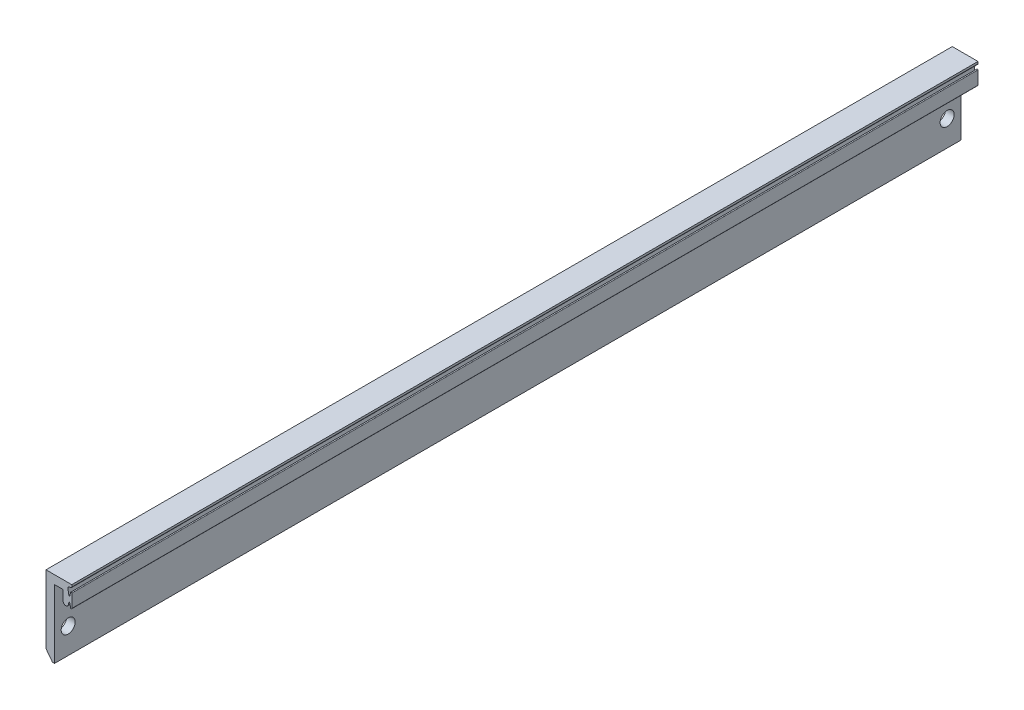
ISO-10303-21;
HEADER;
FILE_DESCRIPTION(('STEP AP214'),'2;1');
FILE_NAME('part.step','',(''),(''),'','','');
FILE_SCHEMA(('AUTOMOTIVE_DESIGN { 1 0 10303 214 1 1 1 1 }'));
ENDSEC;
DATA;
#1=APPLICATION_CONTEXT('core data for automotive mechanical design processes');
#2=APPLICATION_PROTOCOL_DEFINITION('international standard','automotive_design',2000,#1);
#3=PRODUCT_CONTEXT('',#1,'mechanical');
#4=PRODUCT('Part','Part','',(#3));
#5=PRODUCT_RELATED_PRODUCT_CATEGORY('part','',(#4));
#6=PRODUCT_DEFINITION_FORMATION('','',#4);
#7=PRODUCT_DEFINITION_CONTEXT('part definition',#1,'design');
#8=PRODUCT_DEFINITION('design','',#6,#7);
#9=PRODUCT_DEFINITION_SHAPE('','',#8);
#10=(LENGTH_UNIT() NAMED_UNIT(*) SI_UNIT(.MILLI.,.METRE.));
#11=(NAMED_UNIT(*) PLANE_ANGLE_UNIT() SI_UNIT($,.RADIAN.));
#12=(NAMED_UNIT(*) SI_UNIT($,.STERADIAN.) SOLID_ANGLE_UNIT());
#13=UNCERTAINTY_MEASURE_WITH_UNIT(LENGTH_MEASURE(1.E-05),#10,'distance_accuracy_value','');
#14=(GEOMETRIC_REPRESENTATION_CONTEXT(3) GLOBAL_UNCERTAINTY_ASSIGNED_CONTEXT((#13)) GLOBAL_UNIT_ASSIGNED_CONTEXT((#10,
#11,#12)) REPRESENTATION_CONTEXT('',''));
#15=CARTESIAN_POINT('',(0.,0.,0.));
#16=DIRECTION('',(0.,0.,1.));
#17=DIRECTION('',(1.,0.,0.));
#18=AXIS2_PLACEMENT_3D('',#15,#16,#17);
#19=CARTESIAN_POINT('',(2473.35258692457,1.1297441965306E-09,132.675));
#20=DIRECTION('',(1.,4.56766335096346E-13,0.));
#21=DIRECTION('',(-4.56766335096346E-13,1.,0.));
#22=AXIS2_PLACEMENT_3D('',#19,#20,#21);
#23=PLANE('',#22);
#24=DIRECTION('',(4.56766335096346E-13,-1.,0.));
#25=VECTOR('',#24,1.);
#26=CARTESIAN_POINT('',(2473.35258692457,1.1297441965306E-09,-132.675));
#27=LINE('',#26,#25);
#28=CARTESIAN_POINT('',(2473.35258692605,-3238.37710777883,-132.675));
#29=VERTEX_POINT('',#28);
#30=CARTESIAN_POINT('',(2473.35258692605,-3241.29384556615,-132.675));
#31=VERTEX_POINT('',#30);
#32=EDGE_CURVE('E211',#29,#31,#27,.T.);
#33=ORIENTED_EDGE('',*,*,#32,.T.);
#34=DIRECTION('',(0.,0.,-1.));
#35=VECTOR('',#34,1.);
#36=CARTESIAN_POINT('',(2473.35258692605,-3241.29384556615,132.675));
#37=LINE('',#36,#35);
#38=CARTESIAN_POINT('',(2473.35258692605,-3241.29384556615,132.675));
#39=VERTEX_POINT('',#38);
#40=EDGE_CURVE('E11',#39,#31,#37,.T.);
#41=ORIENTED_EDGE('',*,*,#40,.F.);
#42=DIRECTION('',(4.56766335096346E-13,-1.,0.));
#43=VECTOR('',#42,1.);
#44=CARTESIAN_POINT('',(2473.35258692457,1.1297441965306E-09,132.675));
#45=LINE('',#44,#43);
#46=CARTESIAN_POINT('',(2473.35258692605,-3238.37710777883,132.675));
#47=VERTEX_POINT('',#46);
#48=EDGE_CURVE('E265',#47,#39,#45,.T.);
#49=ORIENTED_EDGE('',*,*,#48,.F.);
#50=DIRECTION('',(0.,0.,-1.));
#51=VECTOR('',#50,1.);
#52=CARTESIAN_POINT('',(2473.35258692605,-3238.37710777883,132.675));
#53=LINE('',#52,#51);
#54=EDGE_CURVE('E207',#47,#29,#53,.T.);
#55=ORIENTED_EDGE('',*,*,#54,.T.);
#56=EDGE_LOOP('',(#33,#41,#49,#55));
#57=FACE_BOUND('',#56,.T.);
#58=ADVANCED_FACE('F37',(#57),#23,.F.);
#59=CARTESIAN_POINT('',(2474.13562881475,-3241.29384556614,132.675));
#60=DIRECTION('',(0.,0.,-1.));
#61=DIRECTION('',(-1.,0.,0.));
#62=AXIS2_PLACEMENT_3D('',#59,#60,#61);
#63=CYLINDRICAL_SURFACE('',#62,0.783041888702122);
#64=CARTESIAN_POINT('',(2474.13562881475,-3241.29384556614,-132.675));
#65=DIRECTION('',(0.,0.,1.));
#66=DIRECTION('',(1.,0.,0.));
#67=AXIS2_PLACEMENT_3D('',#64,#65,#66);
#68=CIRCLE('',#67,0.783041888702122);
#69=CARTESIAN_POINT('',(2474.90170185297,-3241.4559773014,-132.675));
#70=VERTEX_POINT('',#69);
#71=EDGE_CURVE('E214',#31,#70,#68,.T.);
#72=ORIENTED_EDGE('',*,*,#71,.T.);
#73=DIRECTION('',(0.,0.,-1.));
#74=VECTOR('',#73,1.);
#75=CARTESIAN_POINT('',(2474.90170185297,-3241.4559773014,132.675));
#76=LINE('',#75,#74);
#77=CARTESIAN_POINT('',(2474.90170185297,-3241.4559773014,132.675));
#78=VERTEX_POINT('',#77);
#79=EDGE_CURVE('E46',#78,#70,#76,.T.);
#80=ORIENTED_EDGE('',*,*,#79,.F.);
#81=CARTESIAN_POINT('',(2474.13562881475,-3241.29384556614,132.675));
#82=DIRECTION('',(0.,0.,1.));
#83=DIRECTION('',(1.,0.,0.));
#84=AXIS2_PLACEMENT_3D('',#81,#82,#83);
#85=CIRCLE('',#84,0.783041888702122);
#86=EDGE_CURVE('E133',#39,#78,#85,.T.);
#87=ORIENTED_EDGE('',*,*,#86,.F.);
#88=ORIENTED_EDGE('',*,*,#40,.T.);
#89=EDGE_LOOP('',(#72,#80,#87,#88));
#90=FACE_BOUND('',#89,.T.);
#91=ADVANCED_FACE('F383',(#90),#63,.T.);
#92=CARTESIAN_POINT('',(3025.41088073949,-640.298106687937,132.675));
#93=DIRECTION('',(-0.978329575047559,0.207053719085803,0.));
#94=DIRECTION('',(-0.207053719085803,-0.978329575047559,0.));
#95=AXIS2_PLACEMENT_3D('',#92,#93,#94);
#96=PLANE('',#95);
#97=DIRECTION('',(0.207053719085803,0.978329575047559,0.));
#98=VECTOR('',#97,1.);
#99=CARTESIAN_POINT('',(3025.41088073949,-640.298106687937,-132.675));
#100=LINE('',#99,#98);
#101=CARTESIAN_POINT('',(2475.03432887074,-3240.82931416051,-132.675));
#102=VERTEX_POINT('',#101);
#103=EDGE_CURVE('E217',#70,#102,#100,.T.);
#104=ORIENTED_EDGE('',*,*,#103,.T.);
#105=DIRECTION('',(0.,0.,-1.));
#106=VECTOR('',#105,1.);
#107=CARTESIAN_POINT('',(2475.03432887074,-3240.82931416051,132.675));
#108=LINE('',#107,#106);
#109=CARTESIAN_POINT('',(2475.03432887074,-3240.82931416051,132.675));
#110=VERTEX_POINT('',#109);
#111=EDGE_CURVE('E301',#110,#102,#108,.T.);
#112=ORIENTED_EDGE('',*,*,#111,.F.);
#113=DIRECTION('',(0.207053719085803,0.978329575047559,0.));
#114=VECTOR('',#113,1.);
#115=CARTESIAN_POINT('',(3025.41088073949,-640.298106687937,132.675));
#116=LINE('',#115,#114);
#117=EDGE_CURVE('E318',#78,#110,#116,.T.);
#118=ORIENTED_EDGE('',*,*,#117,.F.);
#119=ORIENTED_EDGE('',*,*,#79,.T.);
#120=EDGE_LOOP('',(#104,#112,#118,#119));
#121=FACE_BOUND('',#120,.T.);
#122=ADVANCED_FACE('F387',(#121),#96,.F.);
#123=CARTESIAN_POINT('',(2475.18258692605,-3240.85210777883,132.675));
#124=DIRECTION('',(0.,0.,-1.));
#125=DIRECTION('',(-1.,0.,0.));
#126=AXIS2_PLACEMENT_3D('',#123,#124,#125);
#127=CYLINDRICAL_SURFACE('',#126,0.149999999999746);
#128=CARTESIAN_POINT('',(2475.18258692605,-3240.85210777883,-132.675));
#129=DIRECTION('',(0.,0.,1.));
#130=DIRECTION('',(1.,0.,0.));
#131=AXIS2_PLACEMENT_3D('',#128,#129,#130);
#132=CIRCLE('',#131,0.149999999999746);
#133=CARTESIAN_POINT('',(2475.32961411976,-3240.82239239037,-132.675));
#134=VERTEX_POINT('',#133);
#135=EDGE_CURVE('E220',#134,#102,#132,.T.);
#136=ORIENTED_EDGE('',*,*,#135,.F.);
#137=DIRECTION('',(0.,0.,-1.));
#138=VECTOR('',#137,1.);
#139=CARTESIAN_POINT('',(2475.32961411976,-3240.82239239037,132.675));
#140=LINE('',#139,#138);
#141=CARTESIAN_POINT('',(2475.32961411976,-3240.82239239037,132.675));
#142=VERTEX_POINT('',#141);
#143=EDGE_CURVE('E299',#142,#134,#140,.T.);
#144=ORIENTED_EDGE('',*,*,#143,.F.);
#145=CARTESIAN_POINT('',(2475.18258692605,-3240.85210777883,132.675));
#146=DIRECTION('',(0.,0.,1.));
#147=DIRECTION('',(1.,0.,0.));
#148=AXIS2_PLACEMENT_3D('',#145,#146,#147);
#149=CIRCLE('',#148,0.149999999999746);
#150=EDGE_CURVE('E320',#142,#110,#149,.T.);
#151=ORIENTED_EDGE('',*,*,#150,.T.);
#152=ORIENTED_EDGE('',*,*,#111,.T.);
#153=EDGE_LOOP('',(#136,#144,#151,#152));
#154=FACE_BOUND('',#153,.T.);
#155=ADVANCED_FACE('F391',(#154),#127,.F.);
#156=CARTESIAN_POINT('',(1748.89480993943,353.465827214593,132.675));
#157=DIRECTION('',(0.980181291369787,0.19810258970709,0.));
#158=DIRECTION('',(-0.19810258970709,0.980181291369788,0.));
#159=AXIS2_PLACEMENT_3D('',#156,#157,#158);
#160=PLANE('',#159);
#161=DIRECTION('',(0.19810258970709,-0.980181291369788,0.));
#162=VECTOR('',#161,1.);
#163=CARTESIAN_POINT('',(1748.89480993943,353.465827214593,-132.675));
#164=LINE('',#163,#162);
#165=CARTESIAN_POINT('',(2475.55582897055,-3241.94166884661,-132.675));
#166=VERTEX_POINT('',#165);
#167=EDGE_CURVE('E223',#134,#166,#164,.T.);
#168=ORIENTED_EDGE('',*,*,#167,.T.);
#169=DIRECTION('',(0.,0.,-1.));
#170=VECTOR('',#169,1.);
#171=CARTESIAN_POINT('',(2475.55582897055,-3241.94166884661,132.675));
#172=LINE('',#171,#170);
#173=CARTESIAN_POINT('',(2475.55582897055,-3241.94166884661,132.675));
#174=VERTEX_POINT('',#173);
#175=EDGE_CURVE('E296',#174,#166,#172,.T.);
#176=ORIENTED_EDGE('',*,*,#175,.F.);
#177=DIRECTION('',(0.19810258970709,-0.980181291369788,0.));
#178=VECTOR('',#177,1.);
#179=CARTESIAN_POINT('',(1748.89480993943,353.465827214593,132.675));
#180=LINE('',#179,#178);
#181=EDGE_CURVE('E323',#142,#174,#180,.T.);
#182=ORIENTED_EDGE('',*,*,#181,.F.);
#183=ORIENTED_EDGE('',*,*,#143,.T.);
#184=EDGE_LOOP('',(#168,#176,#182,#183));
#185=FACE_BOUND('',#184,.T.);
#186=ADVANCED_FACE('F397',(#185),#160,.F.);
#187=CARTESIAN_POINT('',(2475.72258692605,-3241.90796571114,132.675));
#188=DIRECTION('',(0.,0.,-1.));
#189=DIRECTION('',(-1.,0.,0.));
#190=AXIS2_PLACEMENT_3D('',#187,#188,#189);
#191=CYLINDRICAL_SURFACE('',#190,0.17012970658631);
#192=CARTESIAN_POINT('',(2475.72258692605,-3241.90796571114,-132.675));
#193=DIRECTION('',(0.,0.,1.));
#194=DIRECTION('',(1.,0.,0.));
#195=AXIS2_PLACEMENT_3D('',#192,#193,#194);
#196=CIRCLE('',#195,0.17012970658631);
#197=CARTESIAN_POINT('',(2475.89258692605,-3241.90132364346,-132.675));
#198=VERTEX_POINT('',#197);
#199=EDGE_CURVE('E225',#166,#198,#196,.T.);
#200=ORIENTED_EDGE('',*,*,#199,.T.);
#201=DIRECTION('',(0.,0.,-1.));
#202=VECTOR('',#201,1.);
#203=CARTESIAN_POINT('',(2475.89258692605,-3241.90132364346,132.675));
#204=LINE('',#203,#202);
#205=CARTESIAN_POINT('',(2475.89258692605,-3241.90132364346,132.675));
#206=VERTEX_POINT('',#205);
#207=EDGE_CURVE('E294',#206,#198,#204,.T.);
#208=ORIENTED_EDGE('',*,*,#207,.F.);
#209=CARTESIAN_POINT('',(2475.72258692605,-3241.90796571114,132.675));
#210=DIRECTION('',(0.,0.,1.));
#211=DIRECTION('',(1.,0.,0.));
#212=AXIS2_PLACEMENT_3D('',#209,#210,#211);
#213=CIRCLE('',#212,0.17012970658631);
#214=EDGE_CURVE('E325',#174,#206,#213,.T.);
#215=ORIENTED_EDGE('',*,*,#214,.F.);
#216=ORIENTED_EDGE('',*,*,#175,.T.);
#217=EDGE_LOOP('',(#200,#208,#215,#216));
#218=FACE_BOUND('',#217,.T.);
#219=ADVANCED_FACE('F401',(#218),#191,.T.);
#220=CARTESIAN_POINT('',(2475.89258692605,0.,132.675));
#221=DIRECTION('',(1.,0.,0.));
#222=DIRECTION('',(0.,0.,-1.));
#223=AXIS2_PLACEMENT_3D('',#220,#221,#222);
#224=PLANE('',#223);
#225=DIRECTION('',(0.,-1.,0.));
#226=VECTOR('',#225,1.);
#227=CARTESIAN_POINT('',(2475.89258692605,0.,-132.675));
#228=LINE('',#227,#226);
#229=CARTESIAN_POINT('',(2475.89258692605,-3238.03960777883,-132.675));
#230=VERTEX_POINT('',#229);
#231=EDGE_CURVE('E228',#230,#198,#228,.T.);
#232=ORIENTED_EDGE('',*,*,#231,.F.);
#233=DIRECTION('',(0.,0.,-1.));
#234=VECTOR('',#233,1.);
#235=CARTESIAN_POINT('',(2475.89258692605,-3238.03960777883,132.675));
#236=LINE('',#235,#234);
#237=CARTESIAN_POINT('',(2475.89258692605,-3238.03960777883,132.675));
#238=VERTEX_POINT('',#237);
#239=EDGE_CURVE('E292',#238,#230,#236,.T.);
#240=ORIENTED_EDGE('',*,*,#239,.F.);
#241=DIRECTION('',(0.,-1.,0.));
#242=VECTOR('',#241,1.);
#243=CARTESIAN_POINT('',(2475.89258692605,0.,132.675));
#244=LINE('',#243,#242);
#245=EDGE_CURVE('E327',#238,#206,#244,.T.);
#246=ORIENTED_EDGE('',*,*,#245,.T.);
#247=ORIENTED_EDGE('',*,*,#207,.T.);
#248=EDGE_LOOP('',(#232,#240,#246,#247));
#249=FACE_BOUND('',#248,.T.);
#250=ADVANCED_FACE('F405',(#249),#224,.T.);
#251=CARTESIAN_POINT('',(2475.72258692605,-3238.04624984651,132.675));
#252=DIRECTION('',(0.,0.,-1.));
#253=DIRECTION('',(-1.,0.,0.));
#254=AXIS2_PLACEMENT_3D('',#251,#252,#253);
#255=CYLINDRICAL_SURFACE('',#254,0.17012970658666);
#256=CARTESIAN_POINT('',(2475.72258692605,-3238.04624984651,-132.675));
#257=DIRECTION('',(0.,0.,1.));
#258=DIRECTION('',(1.,0.,0.));
#259=AXIS2_PLACEMENT_3D('',#256,#257,#258);
#260=CIRCLE('',#259,0.17012970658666);
#261=CARTESIAN_POINT('',(2475.55690402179,-3238.00760670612,-132.675));
#262=VERTEX_POINT('',#261);
#263=EDGE_CURVE('E231',#230,#262,#260,.T.);
#264=ORIENTED_EDGE('',*,*,#263,.T.);
#265=DIRECTION('',(0.,0.,-1.));
#266=VECTOR('',#265,1.);
#267=CARTESIAN_POINT('',(2475.55690402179,-3238.00760670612,132.675));
#268=LINE('',#267,#266);
#269=CARTESIAN_POINT('',(2475.55690402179,-3238.00760670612,132.675));
#270=VERTEX_POINT('',#269);
#271=EDGE_CURVE('E289',#270,#262,#268,.T.);
#272=ORIENTED_EDGE('',*,*,#271,.F.);
#273=CARTESIAN_POINT('',(2475.72258692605,-3238.04624984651,132.675));
#274=DIRECTION('',(0.,0.,1.));
#275=DIRECTION('',(1.,0.,0.));
#276=AXIS2_PLACEMENT_3D('',#273,#274,#275);
#277=CIRCLE('',#276,0.17012970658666);
#278=EDGE_CURVE('E330',#238,#270,#277,.T.);
#279=ORIENTED_EDGE('',*,*,#278,.F.);
#280=ORIENTED_EDGE('',*,*,#239,.T.);
#281=EDGE_LOOP('',(#264,#272,#279,#280));
#282=FACE_BOUND('',#281,.T.);
#283=ADVANCED_FACE('F409',(#282),#255,.T.);
#284=CARTESIAN_POINT('',(3064.09234392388,-714.655209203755,132.675));
#285=DIRECTION('',(0.973862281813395,-0.227139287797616,0.));
#286=DIRECTION('',(0.227139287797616,0.973862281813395,0.));
#287=AXIS2_PLACEMENT_3D('',#284,#285,#286);
#288=PLANE('',#287);
#289=DIRECTION('',(-0.227139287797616,-0.973862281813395,0.));
#290=VECTOR('',#289,1.);
#291=CARTESIAN_POINT('',(3064.09234392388,-714.655209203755,-132.675));
#292=LINE('',#291,#290);
#293=CARTESIAN_POINT('',(2475.32866626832,-3238.986178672,-132.675));
#294=VERTEX_POINT('',#293);
#295=EDGE_CURVE('E233',#262,#294,#292,.T.);
#296=ORIENTED_EDGE('',*,*,#295,.T.);
#297=DIRECTION('',(0.,0.,-1.));
#298=VECTOR('',#297,1.);
#299=CARTESIAN_POINT('',(2475.32866626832,-3238.986178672,132.675));
#300=LINE('',#299,#298);
#301=CARTESIAN_POINT('',(2475.32866626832,-3238.986178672,132.675));
#302=VERTEX_POINT('',#301);
#303=EDGE_CURVE('E287',#302,#294,#300,.T.);
#304=ORIENTED_EDGE('',*,*,#303,.F.);
#305=DIRECTION('',(-0.227139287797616,-0.973862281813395,0.));
#306=VECTOR('',#305,1.);
#307=CARTESIAN_POINT('',(3064.09234392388,-714.655209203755,132.675));
#308=LINE('',#307,#306);
#309=EDGE_CURVE('E332',#270,#302,#308,.T.);
#310=ORIENTED_EDGE('',*,*,#309,.F.);
#311=ORIENTED_EDGE('',*,*,#271,.T.);
#312=EDGE_LOOP('',(#296,#304,#310,#311));
#313=FACE_BOUND('',#312,.T.);
#314=ADVANCED_FACE('F413',(#313),#288,.F.);
#315=CARTESIAN_POINT('',(2475.18258692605,-3238.95210777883,132.675));
#316=DIRECTION('',(0.,0.,-1.));
#317=DIRECTION('',(-1.,0.,0.));
#318=AXIS2_PLACEMENT_3D('',#315,#316,#317);
#319=CYLINDRICAL_SURFACE('',#318,0.150000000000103);
#320=CARTESIAN_POINT('',(2475.18258692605,-3238.95210777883,-132.675));
#321=DIRECTION('',(0.,0.,1.));
#322=DIRECTION('',(1.,0.,0.));
#323=AXIS2_PLACEMENT_3D('',#320,#321,#322);
#324=CIRCLE('',#323,0.150000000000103);
#325=CARTESIAN_POINT('',(2475.03361058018,-3238.96960201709,-132.675));
#326=VERTEX_POINT('',#325);
#327=EDGE_CURVE('E236',#326,#294,#324,.T.);
#328=ORIENTED_EDGE('',*,*,#327,.F.);
#329=DIRECTION('',(0.,0.,-1.));
#330=VECTOR('',#329,1.);
#331=CARTESIAN_POINT('',(2475.03361058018,-3238.96960201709,132.675));
#332=LINE('',#331,#330);
#333=CARTESIAN_POINT('',(2475.03361058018,-3238.96960201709,132.675));
#334=VERTEX_POINT('',#333);
#335=EDGE_CURVE('E285',#334,#326,#332,.T.);
#336=ORIENTED_EDGE('',*,*,#335,.F.);
#337=CARTESIAN_POINT('',(2475.18258692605,-3238.95210777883,132.675));
#338=DIRECTION('',(0.,0.,1.));
#339=DIRECTION('',(1.,0.,0.));
#340=AXIS2_PLACEMENT_3D('',#337,#338,#339);
#341=CIRCLE('',#340,0.150000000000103);
#342=EDGE_CURVE('E334',#334,#302,#341,.T.);
#343=ORIENTED_EDGE('',*,*,#342,.T.);
#344=ORIENTED_EDGE('',*,*,#303,.T.);
#345=EDGE_LOOP('',(#328,#336,#343,#344));
#346=FACE_BOUND('',#345,.T.);
#347=ADVANCED_FACE('F417',(#346),#319,.F.);
#348=CARTESIAN_POINT('',(2481.28067168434,-3237.37963252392,132.675));
#349=DIRECTION('',(0.,0.,-1.));
#350=DIRECTION('',(-1.,0.,0.));
#351=AXIS2_PLACEMENT_3D('',#348,#349,#350);
#352=CYLINDRICAL_SURFACE('',#351,6.44622179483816);
#353=CARTESIAN_POINT('',(2481.28067168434,-3237.37963252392,-132.675));
#354=DIRECTION('',(0.,0.,1.));
#355=DIRECTION('',(1.,0.,0.));
#356=AXIS2_PLACEMENT_3D('',#353,#354,#355);
#357=CIRCLE('',#356,6.44622179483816);
#358=CARTESIAN_POINT('',(2474.83964363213,-3237.12091828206,-132.675));
#359=VERTEX_POINT('',#358);
#360=EDGE_CURVE('E239',#359,#326,#357,.T.);
#361=ORIENTED_EDGE('',*,*,#360,.F.);
#362=DIRECTION('',(0.,0.,-1.));
#363=VECTOR('',#362,1.);
#364=CARTESIAN_POINT('',(2474.83964363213,-3237.12091828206,132.675));
#365=LINE('',#364,#363);
#366=CARTESIAN_POINT('',(2474.83964363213,-3237.12091828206,132.675));
#367=VERTEX_POINT('',#366);
#368=EDGE_CURVE('E283',#367,#359,#365,.T.);
#369=ORIENTED_EDGE('',*,*,#368,.F.);
#370=CARTESIAN_POINT('',(2481.28067168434,-3237.37963252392,132.675));
#371=DIRECTION('',(0.,0.,1.));
#372=DIRECTION('',(1.,0.,0.));
#373=AXIS2_PLACEMENT_3D('',#370,#371,#372);
#374=CIRCLE('',#373,6.44622179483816);
#375=EDGE_CURVE('E337',#367,#334,#374,.T.);
#376=ORIENTED_EDGE('',*,*,#375,.T.);
#377=ORIENTED_EDGE('',*,*,#335,.T.);
#378=EDGE_LOOP('',(#361,#369,#376,#377));
#379=FACE_BOUND('',#378,.T.);
#380=ADVANCED_FACE('F421',(#379),#352,.F.);
#381=CARTESIAN_POINT('',(2475.13940192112,-3237.13295855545,132.675));
#382=DIRECTION('',(0.,0.,-1.));
#383=DIRECTION('',(-1.,0.,0.));
#384=AXIS2_PLACEMENT_3D('',#381,#382,#383);
#385=CYLINDRICAL_SURFACE('',#384,0.299999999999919);
#386=CARTESIAN_POINT('',(2475.13940192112,-3237.13295855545,-132.675));
#387=DIRECTION('',(0.,0.,1.));
#388=DIRECTION('',(1.,0.,0.));
#389=AXIS2_PLACEMENT_3D('',#386,#387,#388);
#390=CIRCLE('',#389,0.299999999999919);
#391=CARTESIAN_POINT('',(2475.09145484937,-3236.83681487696,-132.675));
#392=VERTEX_POINT('',#391);
#393=EDGE_CURVE('E242',#392,#359,#390,.T.);
#394=ORIENTED_EDGE('',*,*,#393,.F.);
#395=DIRECTION('',(0.,0.,-1.));
#396=VECTOR('',#395,1.);
#397=CARTESIAN_POINT('',(2475.09145484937,-3236.83681487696,132.675));
#398=LINE('',#397,#396);
#399=CARTESIAN_POINT('',(2475.09145484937,-3236.83681487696,132.675));
#400=VERTEX_POINT('',#399);
#401=EDGE_CURVE('E281',#400,#392,#398,.T.);
#402=ORIENTED_EDGE('',*,*,#401,.F.);
#403=CARTESIAN_POINT('',(2475.13940192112,-3237.13295855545,132.675));
#404=DIRECTION('',(0.,0.,1.));
#405=DIRECTION('',(1.,0.,0.));
#406=AXIS2_PLACEMENT_3D('',#403,#404,#405);
#407=CIRCLE('',#406,0.299999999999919);
#408=EDGE_CURVE('E340',#400,#367,#407,.T.);
#409=ORIENTED_EDGE('',*,*,#408,.T.);
#410=ORIENTED_EDGE('',*,*,#368,.T.);
#411=EDGE_LOOP('',(#394,#402,#409,#410));
#412=FACE_BOUND('',#411,.T.);
#413=ADVANCED_FACE('F425',(#412),#385,.F.);
#414=CARTESIAN_POINT('',(573.895628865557,-3544.64947241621,132.675));
#415=DIRECTION('',(-0.159823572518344,0.987145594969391,0.));
#416=DIRECTION('',(-0.987145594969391,-0.159823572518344,0.));
#417=AXIS2_PLACEMENT_3D('',#414,#415,#416);
#418=PLANE('',#417);
#419=DIRECTION('',(0.987145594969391,0.159823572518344,0.));
#420=VECTOR('',#419,1.);
#421=CARTESIAN_POINT('',(573.895628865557,-3544.64947241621,-132.675));
#422=LINE('',#421,#420);
#423=CARTESIAN_POINT('',(2475.64053399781,-3236.74791634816,-132.675));
#424=VERTEX_POINT('',#423);
#425=EDGE_CURVE('E245',#392,#424,#422,.T.);
#426=ORIENTED_EDGE('',*,*,#425,.T.);
#427=DIRECTION('',(0.,0.,-1.));
#428=VECTOR('',#427,1.);
#429=CARTESIAN_POINT('',(2475.64053399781,-3236.74791634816,132.675));
#430=LINE('',#429,#428);
#431=CARTESIAN_POINT('',(2475.64053399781,-3236.74791634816,132.675));
#432=VERTEX_POINT('',#431);
#433=EDGE_CURVE('E278',#432,#424,#430,.T.);
#434=ORIENTED_EDGE('',*,*,#433,.F.);
#435=DIRECTION('',(0.987145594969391,0.159823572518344,0.));
#436=VECTOR('',#435,1.);
#437=CARTESIAN_POINT('',(573.895628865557,-3544.64947241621,132.675));
#438=LINE('',#437,#436);
#439=EDGE_CURVE('E343',#400,#432,#438,.T.);
#440=ORIENTED_EDGE('',*,*,#439,.F.);
#441=ORIENTED_EDGE('',*,*,#401,.T.);
#442=EDGE_LOOP('',(#426,#434,#440,#441));
#443=FACE_BOUND('',#442,.T.);
#444=ADVANCED_FACE('F429',(#443),#418,.F.);
#445=CARTESIAN_POINT('',(2475.59258692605,-3236.45177266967,132.675));
#446=DIRECTION('',(0.,0.,-1.));
#447=DIRECTION('',(-1.,0.,0.));
#448=AXIS2_PLACEMENT_3D('',#445,#446,#447);
#449=CYLINDRICAL_SURFACE('',#448,0.299999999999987);
#450=CARTESIAN_POINT('',(2475.59258692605,-3236.45177266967,-132.675));
#451=DIRECTION('',(0.,0.,1.));
#452=DIRECTION('',(1.,0.,0.));
#453=AXIS2_PLACEMENT_3D('',#450,#451,#452);
#454=CIRCLE('',#453,0.299999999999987);
#455=CARTESIAN_POINT('',(2475.89258692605,-3236.45177266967,-132.675));
#456=VERTEX_POINT('',#455);
#457=EDGE_CURVE('E247',#424,#456,#454,.T.);
#458=ORIENTED_EDGE('',*,*,#457,.T.);
#459=DIRECTION('',(0.,0.,-1.));
#460=VECTOR('',#459,1.);
#461=CARTESIAN_POINT('',(2475.89258692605,-3236.45177266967,132.675));
#462=LINE('',#461,#460);
#463=CARTESIAN_POINT('',(2475.89258692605,-3236.45177266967,132.675));
#464=VERTEX_POINT('',#463);
#465=EDGE_CURVE('E276',#464,#456,#462,.T.);
#466=ORIENTED_EDGE('',*,*,#465,.F.);
#467=CARTESIAN_POINT('',(2475.59258692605,-3236.45177266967,132.675));
#468=DIRECTION('',(0.,0.,1.));
#469=DIRECTION('',(1.,0.,0.));
#470=AXIS2_PLACEMENT_3D('',#467,#468,#469);
#471=CIRCLE('',#470,0.299999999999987);
#472=EDGE_CURVE('E345',#432,#464,#471,.T.);
#473=ORIENTED_EDGE('',*,*,#472,.F.);
#474=ORIENTED_EDGE('',*,*,#433,.T.);
#475=EDGE_LOOP('',(#458,#466,#473,#474));
#476=FACE_BOUND('',#475,.T.);
#477=ADVANCED_FACE('F433',(#476),#449,.T.);
#478=CARTESIAN_POINT('',(2475.89258693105,-3.82663775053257E-09,132.675));
#479=DIRECTION('',(1.,-1.54555887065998E-12,0.));
#480=DIRECTION('',(1.54555887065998E-12,1.,0.));
#481=AXIS2_PLACEMENT_3D('',#478,#479,#480);
#482=PLANE('',#481);
#483=DIRECTION('',(-1.54555887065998E-12,-1.,0.));
#484=VECTOR('',#483,1.);
#485=CARTESIAN_POINT('',(2475.89258693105,-3.82663775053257E-09,-132.675));
#486=LINE('',#485,#484);
#487=CARTESIAN_POINT('',(2475.89258692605,-3235.87710777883,-132.675));
#488=VERTEX_POINT('',#487);
#489=EDGE_CURVE('E250',#488,#456,#486,.T.);
#490=ORIENTED_EDGE('',*,*,#489,.F.);
#491=DIRECTION('',(0.,0.,-1.));
#492=VECTOR('',#491,1.);
#493=CARTESIAN_POINT('',(2475.89258692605,-3235.87710777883,132.675));
#494=LINE('',#493,#492);
#495=CARTESIAN_POINT('',(2475.89258692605,-3235.87710777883,132.675));
#496=VERTEX_POINT('',#495);
#497=EDGE_CURVE('E274',#496,#488,#494,.T.);
#498=ORIENTED_EDGE('',*,*,#497,.F.);
#499=DIRECTION('',(-1.54555887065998E-12,-1.,0.));
#500=VECTOR('',#499,1.);
#501=CARTESIAN_POINT('',(2475.89258693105,-3.82663775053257E-09,132.675));
#502=LINE('',#501,#500);
#503=EDGE_CURVE('E347',#496,#464,#502,.T.);
#504=ORIENTED_EDGE('',*,*,#503,.T.);
#505=ORIENTED_EDGE('',*,*,#465,.T.);
#506=EDGE_LOOP('',(#490,#498,#504,#505));
#507=FACE_BOUND('',#506,.T.);
#508=ADVANCED_FACE('F437',(#507),#482,.T.);
#509=CARTESIAN_POINT('',(0.,-3235.87710777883,132.675));
#510=DIRECTION('',(0.,1.,0.));
#511=DIRECTION('',(0.,0.,1.));
#512=AXIS2_PLACEMENT_3D('',#509,#510,#511);
#513=PLANE('',#512);
#514=DIRECTION('',(1.,0.,0.));
#515=VECTOR('',#514,1.);
#516=CARTESIAN_POINT('',(0.,-3235.87710777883,-132.675));
#517=LINE('',#516,#515);
#518=CARTESIAN_POINT('',(2468.35258692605,-3235.87710777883,-132.675));
#519=VERTEX_POINT('',#518);
#520=EDGE_CURVE('E253',#519,#488,#517,.T.);
#521=ORIENTED_EDGE('',*,*,#520,.F.);
#522=DIRECTION('',(0.,0.,-1.));
#523=VECTOR('',#522,1.);
#524=CARTESIAN_POINT('',(2468.35258692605,-3235.87710777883,132.675));
#525=LINE('',#524,#523);
#526=CARTESIAN_POINT('',(2468.35258692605,-3235.87710777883,132.675));
#527=VERTEX_POINT('',#526);
#528=EDGE_CURVE('E272',#527,#519,#525,.T.);
#529=ORIENTED_EDGE('',*,*,#528,.F.);
#530=DIRECTION('',(1.,0.,0.));
#531=VECTOR('',#530,1.);
#532=CARTESIAN_POINT('',(0.,-3235.87710777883,132.675));
#533=LINE('',#532,#531);
#534=EDGE_CURVE('E350',#527,#496,#533,.T.);
#535=ORIENTED_EDGE('',*,*,#534,.T.);
#536=ORIENTED_EDGE('',*,*,#497,.T.);
#537=EDGE_LOOP('',(#521,#529,#535,#536));
#538=FACE_BOUND('',#537,.T.);
#539=ADVANCED_FACE('F441',(#538),#513,.T.);
#540=CARTESIAN_POINT('',(2468.35258692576,2.19233749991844E-10,132.675));
#541=DIRECTION('',(1.,0.,0.));
#542=DIRECTION('',(0.,1.,0.));
#543=AXIS2_PLACEMENT_3D('',#540,#541,#542);
#544=PLANE('',#543);
#545=CARTESIAN_POINT('',(2468.35258692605,-3250.87710777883,128.675));
#546=DIRECTION('',(-1.,0.,0.));
#547=DIRECTION('',(0.,1.,0.));
#548=AXIS2_PLACEMENT_3D('',#545,#546,#547);
#549=CIRCLE('',#548,2.04999999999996);
#550=CARTESIAN_POINT('',(2468.35258692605,-3248.82710777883,128.675));
#551=VERTEX_POINT('',#550);
#552=EDGE_CURVE('E313',#551,#551,#549,.T.);
#553=ORIENTED_EDGE('',*,*,#552,.F.);
#554=EDGE_LOOP('',(#553));
#555=FACE_BOUND('',#554,.T.);
#556=CARTESIAN_POINT('',(2468.35258692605,-3250.87710777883,-128.675));
#557=DIRECTION('',(-1.,0.,0.));
#558=DIRECTION('',(0.,-1.,0.));
#559=AXIS2_PLACEMENT_3D('',#556,#557,#558);
#560=CIRCLE('',#559,2.04999999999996);
#561=CARTESIAN_POINT('',(2468.35258692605,-3252.92710777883,-128.675));
#562=VERTEX_POINT('',#561);
#563=EDGE_CURVE('E305',#562,#562,#560,.T.);
#564=ORIENTED_EDGE('',*,*,#563,.F.);
#565=EDGE_LOOP('',(#564));
#566=FACE_BOUND('',#565,.T.);
#567=DIRECTION('',(0.,-1.,0.));
#568=VECTOR('',#567,1.);
#569=CARTESIAN_POINT('',(2468.35258692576,2.19233749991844E-10,-132.675));
#570=LINE('',#569,#568);
#571=CARTESIAN_POINT('',(2468.35258692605,-3255.87710777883,-132.675));
#572=VERTEX_POINT('',#571);
#573=EDGE_CURVE('E256',#519,#572,#570,.T.);
#574=ORIENTED_EDGE('',*,*,#573,.T.);
#575=DIRECTION('',(0.,0.,-1.));
#576=VECTOR('',#575,1.);
#577=CARTESIAN_POINT('',(2468.35258692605,-3255.87710777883,132.675));
#578=LINE('',#577,#576);
#579=CARTESIAN_POINT('',(2468.35258692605,-3255.87710777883,132.675));
#580=VERTEX_POINT('',#579);
#581=EDGE_CURVE('E269',#580,#572,#578,.T.);
#582=ORIENTED_EDGE('',*,*,#581,.F.);
#583=DIRECTION('',(0.,-1.,0.));
#584=VECTOR('',#583,1.);
#585=CARTESIAN_POINT('',(2468.35258692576,2.19233749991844E-10,132.675));
#586=LINE('',#585,#584);
#587=EDGE_CURVE('E353',#527,#580,#586,.T.);
#588=ORIENTED_EDGE('',*,*,#587,.F.);
#589=ORIENTED_EDGE('',*,*,#528,.T.);
#590=EDGE_LOOP('',(#574,#582,#588,#589));
#591=FACE_BOUND('',#590,.T.);
#592=ADVANCED_FACE('F359',(#555,#566,#591),#544,.F.);
#593=CARTESIAN_POINT('',(-3.87551659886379,-2.94539261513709,132.675));
#594=DIRECTION('',(0.796162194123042,0.605083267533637,0.));
#595=DIRECTION('',(-0.605083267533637,0.796162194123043,0.));
#596=AXIS2_PLACEMENT_3D('',#593,#594,#595);
#597=PLANE('',#596);
#598=DIRECTION('',(0.605083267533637,-0.796162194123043,0.));
#599=VECTOR('',#598,1.);
#600=CARTESIAN_POINT('',(-3.87551659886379,-2.94539261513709,-132.675));
#601=LINE('',#600,#599);
#602=CARTESIAN_POINT('',(2470.25258692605,-3258.37710777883,-132.675));
#603=VERTEX_POINT('',#602);
#604=EDGE_CURVE('E258',#572,#603,#601,.T.);
#605=ORIENTED_EDGE('',*,*,#604,.T.);
#606=DIRECTION('',(0.,0.,-1.));
#607=VECTOR('',#606,1.);
#608=CARTESIAN_POINT('',(2470.25258692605,-3258.37710777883,132.675));
#609=LINE('',#608,#607);
#610=CARTESIAN_POINT('',(2470.25258692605,-3258.37710777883,132.675));
#611=VERTEX_POINT('',#610);
#612=EDGE_CURVE('E197',#611,#603,#609,.T.);
#613=ORIENTED_EDGE('',*,*,#612,.F.);
#614=DIRECTION('',(0.605083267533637,-0.796162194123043,0.));
#615=VECTOR('',#614,1.);
#616=CARTESIAN_POINT('',(-3.87551659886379,-2.94539261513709,132.675));
#617=LINE('',#616,#615);
#618=EDGE_CURVE('E202',#580,#611,#617,.T.);
#619=ORIENTED_EDGE('',*,*,#618,.F.);
#620=ORIENTED_EDGE('',*,*,#581,.T.);
#621=EDGE_LOOP('',(#605,#613,#619,#620));
#622=FACE_BOUND('',#621,.T.);
#623=ADVANCED_FACE('F363',(#622),#597,.F.);
#624=CARTESIAN_POINT('',(0.,-3258.37710777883,132.675));
#625=DIRECTION('',(0.,-1.,0.));
#626=DIRECTION('',(0.,0.,-1.));
#627=AXIS2_PLACEMENT_3D('',#624,#625,#626);
#628=PLANE('',#627);
#629=DIRECTION('',(-1.,0.,0.));
#630=VECTOR('',#629,1.);
#631=CARTESIAN_POINT('',(0.,-3258.37710777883,-132.675));
#632=LINE('',#631,#630);
#633=CARTESIAN_POINT('',(2470.85258692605,-3258.37710777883,-132.675));
#634=VERTEX_POINT('',#633);
#635=EDGE_CURVE('E192',#634,#603,#632,.T.);
#636=ORIENTED_EDGE('',*,*,#635,.F.);
#637=DIRECTION('',(0.,0.,-1.));
#638=VECTOR('',#637,1.);
#639=CARTESIAN_POINT('',(2470.85258692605,-3258.37710777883,132.675));
#640=LINE('',#639,#638);
#641=CARTESIAN_POINT('',(2470.85258692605,-3258.37710777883,132.675));
#642=VERTEX_POINT('',#641);
#643=EDGE_CURVE('E187',#642,#634,#640,.T.);
#644=ORIENTED_EDGE('',*,*,#643,.F.);
#645=DIRECTION('',(-1.,0.,0.));
#646=VECTOR('',#645,1.);
#647=CARTESIAN_POINT('',(0.,-3258.37710777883,132.675));
#648=LINE('',#647,#646);
#649=EDGE_CURVE('E190',#642,#611,#648,.T.);
#650=ORIENTED_EDGE('',*,*,#649,.T.);
#651=ORIENTED_EDGE('',*,*,#612,.T.);
#652=EDGE_LOOP('',(#636,#644,#650,#651));
#653=FACE_BOUND('',#652,.T.);
#654=ADVANCED_FACE('F189',(#653),#628,.T.);
#655=CARTESIAN_POINT('',(2470.85258692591,1.09727897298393E-10,132.675));
#656=DIRECTION('',(1.,0.,0.));
#657=DIRECTION('',(0.,1.,0.));
#658=AXIS2_PLACEMENT_3D('',#655,#656,#657);
#659=PLANE('',#658);
#660=CARTESIAN_POINT('',(2470.85258692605,-3250.87710777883,128.675));
#661=DIRECTION('',(1.,0.,0.));
#662=DIRECTION('',(0.,1.,0.));
#663=AXIS2_PLACEMENT_3D('',#660,#661,#662);
#664=CIRCLE('',#663,2.04999999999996);
#665=CARTESIAN_POINT('',(2470.85258692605,-3248.82710777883,128.675));
#666=VERTEX_POINT('',#665);
#667=EDGE_CURVE('E40',#666,#666,#664,.T.);
#668=ORIENTED_EDGE('',*,*,#667,.F.);
#669=EDGE_LOOP('',(#668));
#670=FACE_BOUND('',#669,.T.);
#671=CARTESIAN_POINT('',(2470.85258692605,-3250.87710777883,-128.675));
#672=DIRECTION('',(1.,0.,0.));
#673=DIRECTION('',(0.,1.,0.));
#674=AXIS2_PLACEMENT_3D('',#671,#672,#673);
#675=CIRCLE('',#674,2.04999999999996);
#676=CARTESIAN_POINT('',(2470.85258692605,-3248.82710777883,-128.675));
#677=VERTEX_POINT('',#676);
#678=EDGE_CURVE('E215',#677,#677,#675,.T.);
#679=ORIENTED_EDGE('',*,*,#678,.F.);
#680=EDGE_LOOP('',(#679));
#681=FACE_BOUND('',#680,.T.);
#682=DIRECTION('',(0.,-1.,0.));
#683=VECTOR('',#682,1.);
#684=CARTESIAN_POINT('',(2470.85258692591,1.09727897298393E-10,-132.675));
#685=LINE('',#684,#683);
#686=CARTESIAN_POINT('',(2470.85258692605,-3238.37710777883,-132.675));
#687=VERTEX_POINT('',#686);
#688=EDGE_CURVE('E262',#687,#634,#685,.T.);
#689=ORIENTED_EDGE('',*,*,#688,.F.);
#690=DIRECTION('',(0.,0.,-1.));
#691=VECTOR('',#690,1.);
#692=CARTESIAN_POINT('',(2470.85258692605,-3238.37710777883,132.675));
#693=LINE('',#692,#691);
#694=CARTESIAN_POINT('',(2470.85258692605,-3238.37710777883,132.675));
#695=VERTEX_POINT('',#694);
#696=EDGE_CURVE('E122',#695,#687,#693,.T.);
#697=ORIENTED_EDGE('',*,*,#696,.F.);
#698=DIRECTION('',(0.,-1.,0.));
#699=VECTOR('',#698,1.);
#700=CARTESIAN_POINT('',(2470.85258692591,1.09727897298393E-10,132.675));
#701=LINE('',#700,#699);
#702=EDGE_CURVE('E200',#695,#642,#701,.T.);
#703=ORIENTED_EDGE('',*,*,#702,.T.);
#704=ORIENTED_EDGE('',*,*,#643,.T.);
#705=EDGE_LOOP('',(#689,#697,#703,#704));
#706=FACE_BOUND('',#705,.T.);
#707=ADVANCED_FACE('F205',(#670,#681,#706),#659,.T.);
#708=CARTESIAN_POINT('',(0.,-3238.37710777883,132.675));
#709=DIRECTION('',(0.,1.,0.));
#710=DIRECTION('',(0.,0.,1.));
#711=AXIS2_PLACEMENT_3D('',#708,#709,#710);
#712=PLANE('',#711);
#713=DIRECTION('',(1.,0.,0.));
#714=VECTOR('',#713,1.);
#715=CARTESIAN_POINT('',(0.,-3238.37710777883,-132.675));
#716=LINE('',#715,#714);
#717=EDGE_CURVE('E125',#687,#29,#716,.T.);
#718=ORIENTED_EDGE('',*,*,#717,.T.);
#719=ORIENTED_EDGE('',*,*,#54,.F.);
#720=DIRECTION('',(1.,0.,0.));
#721=VECTOR('',#720,1.);
#722=CARTESIAN_POINT('',(0.,-3238.37710777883,132.675));
#723=LINE('',#722,#721);
#724=EDGE_CURVE('E55',#695,#47,#723,.T.);
#725=ORIENTED_EDGE('',*,*,#724,.F.);
#726=ORIENTED_EDGE('',*,*,#696,.T.);
#727=EDGE_LOOP('',(#718,#719,#725,#726));
#728=FACE_BOUND('',#727,.T.);
#729=ADVANCED_FACE('F371',(#728),#712,.F.);
#730=CARTESIAN_POINT('',(0.,0.,132.675));
#731=DIRECTION('',(0.,0.,1.));
#732=DIRECTION('',(1.,0.,0.));
#733=AXIS2_PLACEMENT_3D('',#730,#731,#732);
#734=PLANE('',#733);
#735=ORIENTED_EDGE('',*,*,#48,.T.);
#736=ORIENTED_EDGE('',*,*,#86,.T.);
#737=ORIENTED_EDGE('',*,*,#117,.T.);
#738=ORIENTED_EDGE('',*,*,#150,.F.);
#739=ORIENTED_EDGE('',*,*,#181,.T.);
#740=ORIENTED_EDGE('',*,*,#214,.T.);
#741=ORIENTED_EDGE('',*,*,#245,.F.);
#742=ORIENTED_EDGE('',*,*,#278,.T.);
#743=ORIENTED_EDGE('',*,*,#309,.T.);
#744=ORIENTED_EDGE('',*,*,#342,.F.);
#745=ORIENTED_EDGE('',*,*,#375,.F.);
#746=ORIENTED_EDGE('',*,*,#408,.F.);
#747=ORIENTED_EDGE('',*,*,#439,.T.);
#748=ORIENTED_EDGE('',*,*,#472,.T.);
#749=ORIENTED_EDGE('',*,*,#503,.F.);
#750=ORIENTED_EDGE('',*,*,#534,.F.);
#751=ORIENTED_EDGE('',*,*,#587,.T.);
#752=ORIENTED_EDGE('',*,*,#618,.T.);
#753=ORIENTED_EDGE('',*,*,#649,.F.);
#754=ORIENTED_EDGE('',*,*,#702,.F.);
#755=ORIENTED_EDGE('',*,*,#724,.T.);
#756=EDGE_LOOP('',(#735,#736,#737,#738,#739,#740,#741,#742,#743,#744,#745,#746,#747,#748,#749,
#750,#751,#752,#753,#754,#755));
#757=FACE_BOUND('',#756,.T.);
#758=ADVANCED_FACE('F199',(#757),#734,.T.);
#759=CARTESIAN_POINT('',(0.,0.,-132.675));
#760=DIRECTION('',(0.,0.,1.));
#761=DIRECTION('',(1.,0.,0.));
#762=AXIS2_PLACEMENT_3D('',#759,#760,#761);
#763=PLANE('',#762);
#764=ORIENTED_EDGE('',*,*,#32,.F.);
#765=ORIENTED_EDGE('',*,*,#717,.F.);
#766=ORIENTED_EDGE('',*,*,#688,.T.);
#767=ORIENTED_EDGE('',*,*,#635,.T.);
#768=ORIENTED_EDGE('',*,*,#604,.F.);
#769=ORIENTED_EDGE('',*,*,#573,.F.);
#770=ORIENTED_EDGE('',*,*,#520,.T.);
#771=ORIENTED_EDGE('',*,*,#489,.T.);
#772=ORIENTED_EDGE('',*,*,#457,.F.);
#773=ORIENTED_EDGE('',*,*,#425,.F.);
#774=ORIENTED_EDGE('',*,*,#393,.T.);
#775=ORIENTED_EDGE('',*,*,#360,.T.);
#776=ORIENTED_EDGE('',*,*,#327,.T.);
#777=ORIENTED_EDGE('',*,*,#295,.F.);
#778=ORIENTED_EDGE('',*,*,#263,.F.);
#779=ORIENTED_EDGE('',*,*,#231,.T.);
#780=ORIENTED_EDGE('',*,*,#199,.F.);
#781=ORIENTED_EDGE('',*,*,#167,.F.);
#782=ORIENTED_EDGE('',*,*,#135,.T.);
#783=ORIENTED_EDGE('',*,*,#103,.F.);
#784=ORIENTED_EDGE('',*,*,#71,.F.);
#785=EDGE_LOOP('',(#764,#765,#766,#767,#768,#769,#770,#771,#772,#773,#774,#775,#776,#777,#778,
#779,#780,#781,#782,#783,#784));
#786=FACE_BOUND('',#785,.T.);
#787=ADVANCED_FACE('F366',(#786),#763,.F.);
#788=CARTESIAN_POINT('',(2475.89271663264,-3250.87710777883,-128.675));
#789=DIRECTION('',(-1.,0.,0.));
#790=DIRECTION('',(0.,-1.,0.));
#791=AXIS2_PLACEMENT_3D('',#788,#789,#790);
#792=CYLINDRICAL_SURFACE('',#791,2.04999999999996);
#793=ORIENTED_EDGE('',*,*,#678,.T.);
#794=EDGE_LOOP('',(#793));
#795=FACE_BOUND('',#794,.T.);
#796=ORIENTED_EDGE('',*,*,#563,.T.);
#797=EDGE_LOOP('',(#796));
#798=FACE_BOUND('',#797,.T.);
#799=ADVANCED_FACE('F470',(#795,#798),#792,.F.);
#800=CARTESIAN_POINT('',(2475.89271663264,-3250.87710777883,128.675));
#801=DIRECTION('',(-1.,0.,0.));
#802=DIRECTION('',(0.,-1.,0.));
#803=AXIS2_PLACEMENT_3D('',#800,#801,#802);
#804=CYLINDRICAL_SURFACE('',#803,2.04999999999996);
#805=ORIENTED_EDGE('',*,*,#667,.T.);
#806=EDGE_LOOP('',(#805));
#807=FACE_BOUND('',#806,.T.);
#808=ORIENTED_EDGE('',*,*,#552,.T.);
#809=EDGE_LOOP('',(#808));
#810=FACE_BOUND('',#809,.T.);
#811=ADVANCED_FACE('F475',(#807,#810),#804,.F.);
#812=CLOSED_SHELL('',(#58,#91,#122,#155,#186,#219,#250,#283,#314,#347,#380,#413,#444,#477,#508,
#539,#592,#623,#654,#707,#729,#758,#787,#799,#811));
#813=MANIFOLD_SOLID_BREP('B2',#812);
#814=ADVANCED_BREP_SHAPE_REPRESENTATION('',(#18,#813),#14);
#815=SHAPE_DEFINITION_REPRESENTATION(#9,#814);
ENDSEC;
END-ISO-10303-21;
